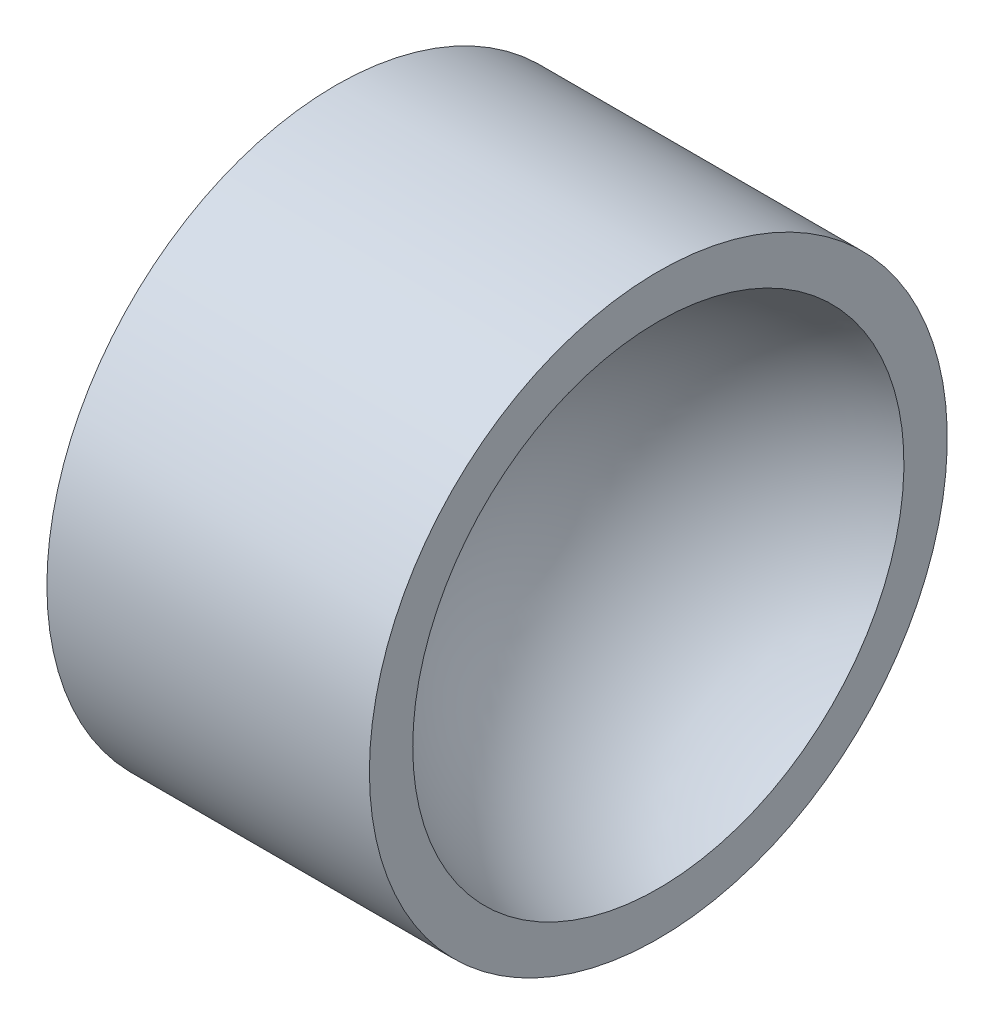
ISO-10303-21;
HEADER;
FILE_DESCRIPTION(('STEP AP214'),'2;1');
FILE_NAME('part.step','',(''),(''),'','','');
FILE_SCHEMA(('AUTOMOTIVE_DESIGN { 1 0 10303 214 1 1 1 1 }'));
ENDSEC;
DATA;
#1=APPLICATION_CONTEXT('core data for automotive mechanical design processes');
#2=APPLICATION_PROTOCOL_DEFINITION('international standard','automotive_design',2000,#1);
#3=PRODUCT_CONTEXT('',#1,'mechanical');
#4=PRODUCT('Part','Part','',(#3));
#5=PRODUCT_RELATED_PRODUCT_CATEGORY('part','',(#4));
#6=PRODUCT_DEFINITION_FORMATION('','',#4);
#7=PRODUCT_DEFINITION_CONTEXT('part definition',#1,'design');
#8=PRODUCT_DEFINITION('design','',#6,#7);
#9=PRODUCT_DEFINITION_SHAPE('','',#8);
#10=(LENGTH_UNIT() NAMED_UNIT(*) SI_UNIT(.MILLI.,.METRE.));
#11=(NAMED_UNIT(*) PLANE_ANGLE_UNIT() SI_UNIT($,.RADIAN.));
#12=(NAMED_UNIT(*) SI_UNIT($,.STERADIAN.) SOLID_ANGLE_UNIT());
#13=UNCERTAINTY_MEASURE_WITH_UNIT(LENGTH_MEASURE(1.E-05),#10,'distance_accuracy_value','');
#14=(GEOMETRIC_REPRESENTATION_CONTEXT(3) GLOBAL_UNCERTAINTY_ASSIGNED_CONTEXT((#13)) GLOBAL_UNIT_ASSIGNED_CONTEXT((#10,
#11,#12)) REPRESENTATION_CONTEXT('',''));
#15=CARTESIAN_POINT('',(0.,0.,0.));
#16=DIRECTION('',(0.,0.,1.));
#17=DIRECTION('',(1.,0.,0.));
#18=AXIS2_PLACEMENT_3D('',#15,#16,#17);
#19=CARTESIAN_POINT('',(54.245,0.,0.));
#20=DIRECTION('',(-1.,0.,0.));
#21=DIRECTION('',(0.,1.,0.));
#22=AXIS2_PLACEMENT_3D('',#19,#20,#21);
#23=SPHERICAL_SURFACE('',#22,3.55);
#24=CARTESIAN_POINT('',(51.3119981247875,0.,0.));
#25=DIRECTION('',(-1.,0.,0.));
#26=DIRECTION('',(0.,0.,1.));
#27=AXIS2_PLACEMENT_3D('',#24,#25,#26);
#28=CIRCLE('',#27,2.);
#29=CARTESIAN_POINT('',(51.3119981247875,0.,2.));
#30=VERTEX_POINT('',#29);
#31=EDGE_CURVE('E48',#30,#30,#28,.T.);
#32=ORIENTED_EDGE('',*,*,#31,.T.);
#33=EDGE_LOOP('',(#32));
#34=FACE_BOUND('',#33,.T.);
#35=ADVANCED_FACE('F35',(#34),#23,.T.);
#36=CARTESIAN_POINT('',(54.0763,0.,0.));
#37=DIRECTION('',(-1.,0.,0.));
#38=DIRECTION('',(0.,1.,0.));
#39=AXIS2_PLACEMENT_3D('',#36,#37,#38);
#40=SPHERICAL_SURFACE('',#39,1.7813);
#41=CARTESIAN_POINT('',(53.5442946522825,0.,0.));
#42=DIRECTION('',(-1.,0.,0.));
#43=DIRECTION('',(0.,0.,1.));
#44=AXIS2_PLACEMENT_3D('',#41,#42,#43);
#45=CIRCLE('',#44,1.7);
#46=CARTESIAN_POINT('',(53.5442946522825,0.,1.7));
#47=VERTEX_POINT('',#46);
#48=EDGE_CURVE('E10',#47,#47,#45,.T.);
#49=ORIENTED_EDGE('',*,*,#48,.F.);
#50=EDGE_LOOP('',(#49));
#51=FACE_BOUND('',#50,.T.);
#52=ADVANCED_FACE('F63',(#51),#40,.F.);
#53=CARTESIAN_POINT('',(53.5442946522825,1.7,0.));
#54=DIRECTION('',(-1.,0.,0.));
#55=DIRECTION('',(0.,0.,1.));
#56=AXIS2_PLACEMENT_3D('',#53,#54,#55);
#57=PLANE('',#56);
#58=CARTESIAN_POINT('',(53.5442946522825,0.,0.));
#59=DIRECTION('',(-1.,0.,0.));
#60=DIRECTION('',(0.,0.,1.));
#61=AXIS2_PLACEMENT_3D('',#58,#59,#60);
#62=CIRCLE('',#61,2.);
#63=CARTESIAN_POINT('',(53.5442946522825,0.,2.));
#64=VERTEX_POINT('',#63);
#65=EDGE_CURVE('E42',#64,#64,#62,.T.);
#66=ORIENTED_EDGE('',*,*,#65,.F.);
#67=EDGE_LOOP('',(#66));
#68=FACE_BOUND('',#67,.T.);
#69=ORIENTED_EDGE('',*,*,#48,.T.);
#70=EDGE_LOOP('',(#69));
#71=FACE_BOUND('',#70,.T.);
#72=ADVANCED_FACE('F58',(#68,#71),#57,.F.);
#73=CARTESIAN_POINT('',(50.695,0.,0.));
#74=DIRECTION('',(-1.,0.,0.));
#75=DIRECTION('',(0.,0.,1.));
#76=AXIS2_PLACEMENT_3D('',#73,#74,#75);
#77=CYLINDRICAL_SURFACE('',#76,2.);
#78=ORIENTED_EDGE('',*,*,#31,.F.);
#79=EDGE_LOOP('',(#78));
#80=FACE_BOUND('',#79,.T.);
#81=ORIENTED_EDGE('',*,*,#65,.T.);
#82=EDGE_LOOP('',(#81));
#83=FACE_BOUND('',#82,.T.);
#84=ADVANCED_FACE('F56',(#80,#83),#77,.T.);
#85=CLOSED_SHELL('',(#35,#52,#72,#84));
#86=MANIFOLD_SOLID_BREP('B2',#85);
#87=ADVANCED_BREP_SHAPE_REPRESENTATION('',(#18,#86),#14);
#88=SHAPE_DEFINITION_REPRESENTATION(#9,#87);
ENDSEC;
END-ISO-10303-21;
